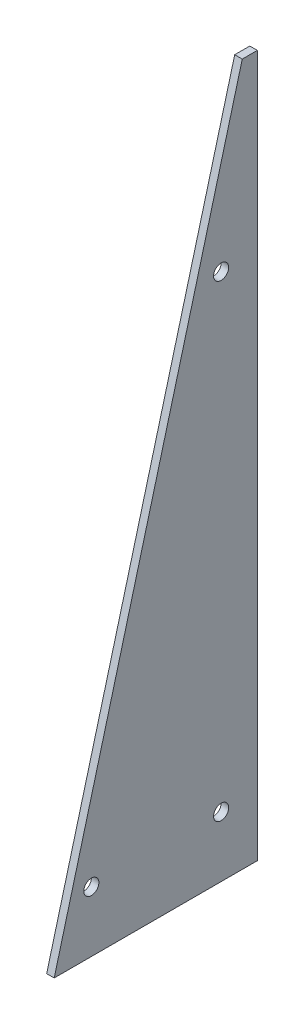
ISO-10303-21;
HEADER;
FILE_DESCRIPTION(('STEP AP214'),'2;1');
FILE_NAME('part.step','',(''),(''),'','','');
FILE_SCHEMA(('AUTOMOTIVE_DESIGN { 1 0 10303 214 1 1 1 1 }'));
ENDSEC;
DATA;
#1=APPLICATION_CONTEXT('core data for automotive mechanical design processes');
#2=APPLICATION_PROTOCOL_DEFINITION('international standard','automotive_design',2000,#1);
#3=PRODUCT_CONTEXT('',#1,'mechanical');
#4=PRODUCT('Part','Part','',(#3));
#5=PRODUCT_RELATED_PRODUCT_CATEGORY('part','',(#4));
#6=PRODUCT_DEFINITION_FORMATION('','',#4);
#7=PRODUCT_DEFINITION_CONTEXT('part definition',#1,'design');
#8=PRODUCT_DEFINITION('design','',#6,#7);
#9=PRODUCT_DEFINITION_SHAPE('','',#8);
#10=(LENGTH_UNIT() NAMED_UNIT(*) SI_UNIT(.MILLI.,.METRE.));
#11=(NAMED_UNIT(*) PLANE_ANGLE_UNIT() SI_UNIT($,.RADIAN.));
#12=(NAMED_UNIT(*) SI_UNIT($,.STERADIAN.) SOLID_ANGLE_UNIT());
#13=UNCERTAINTY_MEASURE_WITH_UNIT(LENGTH_MEASURE(1.E-05),#10,'distance_accuracy_value','');
#14=(GEOMETRIC_REPRESENTATION_CONTEXT(3) GLOBAL_UNCERTAINTY_ASSIGNED_CONTEXT((#13)) GLOBAL_UNIT_ASSIGNED_CONTEXT((#10,
#11,#12)) REPRESENTATION_CONTEXT('',''));
#15=CARTESIAN_POINT('',(0.,0.,0.));
#16=DIRECTION('',(0.,0.,1.));
#17=DIRECTION('',(1.,0.,0.));
#18=AXIS2_PLACEMENT_3D('',#15,#16,#17);
#19=CARTESIAN_POINT('',(6.35,0.,170.937395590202));
#20=DIRECTION('',(0.,1.,0.));
#21=DIRECTION('',(0.,0.,1.));
#22=AXIS2_PLACEMENT_3D('',#19,#20,#21);
#23=PLANE('',#22);
#24=CARTESIAN_POINT('',(3.175,0.,12.7));
#25=DIRECTION('',(0.,-1.,0.));
#26=DIRECTION('',(0.,0.,-1.));
#27=AXIS2_PLACEMENT_3D('',#24,#25,#26);
#28=CIRCLE('',#27,1.35255);
#29=CARTESIAN_POINT('',(3.175,0.,11.34745));
#30=VERTEX_POINT('',#29);
#31=EDGE_CURVE('E123',#30,#30,#28,.T.);
#32=ORIENTED_EDGE('',*,*,#31,.F.);
#33=EDGE_LOOP('',(#32));
#34=FACE_BOUND('',#33,.T.);
#35=CARTESIAN_POINT('',(3.17499999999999,0.,85.725));
#36=DIRECTION('',(0.,-1.,0.));
#37=DIRECTION('',(0.,0.,-1.));
#38=AXIS2_PLACEMENT_3D('',#35,#36,#37);
#39=CIRCLE('',#38,1.35255);
#40=CARTESIAN_POINT('',(3.17499999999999,0.,84.37245));
#41=VERTEX_POINT('',#40);
#42=EDGE_CURVE('E122',#41,#41,#39,.T.);
#43=ORIENTED_EDGE('',*,*,#42,.F.);
#44=EDGE_LOOP('',(#43));
#45=FACE_BOUND('',#44,.T.);
#46=CARTESIAN_POINT('',(3.17499999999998,0.,158.75));
#47=DIRECTION('',(0.,-1.,0.));
#48=DIRECTION('',(0.,0.,-1.));
#49=AXIS2_PLACEMENT_3D('',#46,#47,#48);
#50=CIRCLE('',#49,1.35255);
#51=CARTESIAN_POINT('',(3.17499999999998,0.,157.39745));
#52=VERTEX_POINT('',#51);
#53=EDGE_CURVE('E133',#52,#52,#50,.T.);
#54=ORIENTED_EDGE('',*,*,#53,.F.);
#55=EDGE_LOOP('',(#54));
#56=FACE_BOUND('',#55,.T.);
#57=DIRECTION('',(0.,0.,-1.));
#58=VECTOR('',#57,1.);
#59=CARTESIAN_POINT('',(0.,0.,170.937395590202));
#60=LINE('',#59,#58);
#61=CARTESIAN_POINT('',(0.,0.,170.937395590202));
#62=VERTEX_POINT('',#61);
#63=CARTESIAN_POINT('',(0.,0.,0.));
#64=VERTEX_POINT('',#63);
#65=EDGE_CURVE('E193',#62,#64,#60,.T.);
#66=ORIENTED_EDGE('',*,*,#65,.T.);
#67=DIRECTION('',(-1.,0.,0.));
#68=VECTOR('',#67,1.);
#69=CARTESIAN_POINT('',(6.35,0.,0.));
#70=LINE('',#69,#68);
#71=CARTESIAN_POINT('',(6.35,0.,0.));
#72=VERTEX_POINT('',#71);
#73=EDGE_CURVE('E11',#72,#64,#70,.T.);
#74=ORIENTED_EDGE('',*,*,#73,.F.);
#75=DIRECTION('',(0.,0.,-1.));
#76=VECTOR('',#75,1.);
#77=CARTESIAN_POINT('',(6.35,0.,170.937395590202));
#78=LINE('',#77,#76);
#79=CARTESIAN_POINT('',(6.35,0.,170.937395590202));
#80=VERTEX_POINT('',#79);
#81=EDGE_CURVE('E194',#80,#72,#78,.T.);
#82=ORIENTED_EDGE('',*,*,#81,.F.);
#83=DIRECTION('',(-1.,0.,0.));
#84=VECTOR('',#83,1.);
#85=CARTESIAN_POINT('',(6.35,0.,170.937395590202));
#86=LINE('',#85,#84);
#87=EDGE_CURVE('E200',#80,#62,#86,.T.);
#88=ORIENTED_EDGE('',*,*,#87,.T.);
#89=EDGE_LOOP('',(#66,#74,#82,#88));
#90=FACE_BOUND('',#89,.T.);
#91=ADVANCED_FACE('F37',(#34,#45,#56,#90),#23,.F.);
#92=CARTESIAN_POINT('',(6.35,0.,0.));
#93=DIRECTION('',(0.,0.,1.));
#94=DIRECTION('',(1.,0.,0.));
#95=AXIS2_PLACEMENT_3D('',#92,#93,#94);
#96=PLANE('',#95);
#97=CARTESIAN_POINT('',(3.175,571.5,0.));
#98=DIRECTION('',(0.,0.,-1.));
#99=DIRECTION('',(-1.,0.,0.));
#100=AXIS2_PLACEMENT_3D('',#97,#98,#99);
#101=CIRCLE('',#100,1.1303);
#102=CARTESIAN_POINT('',(2.0447,571.5,0.));
#103=VERTEX_POINT('',#102);
#104=EDGE_CURVE('E139',#103,#103,#101,.T.);
#105=ORIENTED_EDGE('',*,*,#104,.F.);
#106=EDGE_LOOP('',(#105));
#107=FACE_BOUND('',#106,.T.);
#108=CARTESIAN_POINT('',(3.175,462.28,0.));
#109=DIRECTION('',(0.,0.,-1.));
#110=DIRECTION('',(-1.,0.,0.));
#111=AXIS2_PLACEMENT_3D('',#108,#109,#110);
#112=CIRCLE('',#111,1.1303);
#113=CARTESIAN_POINT('',(2.0447,462.28,0.));
#114=VERTEX_POINT('',#113);
#115=EDGE_CURVE('E145',#114,#114,#112,.T.);
#116=ORIENTED_EDGE('',*,*,#115,.F.);
#117=EDGE_LOOP('',(#116));
#118=FACE_BOUND('',#117,.T.);
#119=CARTESIAN_POINT('',(3.175,353.06,0.));
#120=DIRECTION('',(0.,0.,-1.));
#121=DIRECTION('',(-1.,0.,0.));
#122=AXIS2_PLACEMENT_3D('',#119,#120,#121);
#123=CIRCLE('',#122,1.1303);
#124=CARTESIAN_POINT('',(2.0447,353.06,0.));
#125=VERTEX_POINT('',#124);
#126=EDGE_CURVE('E151',#125,#125,#123,.T.);
#127=ORIENTED_EDGE('',*,*,#126,.F.);
#128=EDGE_LOOP('',(#127));
#129=FACE_BOUND('',#128,.T.);
#130=CARTESIAN_POINT('',(3.175,243.84,0.));
#131=DIRECTION('',(0.,0.,-1.));
#132=DIRECTION('',(-1.,0.,0.));
#133=AXIS2_PLACEMENT_3D('',#130,#131,#132);
#134=CIRCLE('',#133,1.1303);
#135=CARTESIAN_POINT('',(2.0447,243.84,0.));
#136=VERTEX_POINT('',#135);
#137=EDGE_CURVE('E157',#136,#136,#134,.T.);
#138=ORIENTED_EDGE('',*,*,#137,.F.);
#139=EDGE_LOOP('',(#138));
#140=FACE_BOUND('',#139,.T.);
#141=CARTESIAN_POINT('',(3.175,134.62,0.));
#142=DIRECTION('',(0.,0.,-1.));
#143=DIRECTION('',(-1.,0.,0.));
#144=AXIS2_PLACEMENT_3D('',#141,#142,#143);
#145=CIRCLE('',#144,1.1303);
#146=CARTESIAN_POINT('',(2.0447,134.62,0.));
#147=VERTEX_POINT('',#146);
#148=EDGE_CURVE('E163',#147,#147,#145,.T.);
#149=ORIENTED_EDGE('',*,*,#148,.F.);
#150=EDGE_LOOP('',(#149));
#151=FACE_BOUND('',#150,.T.);
#152=CARTESIAN_POINT('',(3.175,25.4,0.));
#153=DIRECTION('',(0.,0.,-1.));
#154=DIRECTION('',(-1.,0.,0.));
#155=AXIS2_PLACEMENT_3D('',#152,#153,#154);
#156=CIRCLE('',#155,1.1303);
#157=CARTESIAN_POINT('',(2.0447,25.4,0.));
#158=VERTEX_POINT('',#157);
#159=EDGE_CURVE('E169',#158,#158,#156,.T.);
#160=ORIENTED_EDGE('',*,*,#159,.F.);
#161=EDGE_LOOP('',(#160));
#162=FACE_BOUND('',#161,.T.);
#163=DIRECTION('',(0.,1.,0.));
#164=VECTOR('',#163,1.);
#165=CARTESIAN_POINT('',(0.,0.,0.));
#166=LINE('',#165,#164);
#167=CARTESIAN_POINT('',(0.,590.55,0.));
#168=VERTEX_POINT('',#167);
#169=EDGE_CURVE('E203',#64,#168,#166,.T.);
#170=ORIENTED_EDGE('',*,*,#169,.T.);
#171=DIRECTION('',(-1.,0.,0.));
#172=VECTOR('',#171,1.);
#173=CARTESIAN_POINT('',(6.35,590.55,0.));
#174=LINE('',#173,#172);
#175=CARTESIAN_POINT('',(6.35,590.55,0.));
#176=VERTEX_POINT('',#175);
#177=EDGE_CURVE('E45',#176,#168,#174,.T.);
#178=ORIENTED_EDGE('',*,*,#177,.F.);
#179=DIRECTION('',(0.,1.,0.));
#180=VECTOR('',#179,1.);
#181=CARTESIAN_POINT('',(6.35,0.,0.));
#182=LINE('',#181,#180);
#183=EDGE_CURVE('E84',#72,#176,#182,.T.);
#184=ORIENTED_EDGE('',*,*,#183,.F.);
#185=ORIENTED_EDGE('',*,*,#73,.T.);
#186=EDGE_LOOP('',(#170,#178,#184,#185));
#187=FACE_BOUND('',#186,.T.);
#188=ADVANCED_FACE('F227',(#107,#118,#129,#140,#151,#162,#187),#96,.F.);
#189=CARTESIAN_POINT('',(6.35,590.55,0.));
#190=DIRECTION('',(0.,-1.,0.));
#191=DIRECTION('',(0.,0.,-1.));
#192=AXIS2_PLACEMENT_3D('',#189,#190,#191);
#193=PLANE('',#192);
#194=DIRECTION('',(0.,0.,1.));
#195=VECTOR('',#194,1.);
#196=CARTESIAN_POINT('',(0.,590.55,0.));
#197=LINE('',#196,#195);
#198=CARTESIAN_POINT('',(0.,590.55,12.7));
#199=VERTEX_POINT('',#198);
#200=EDGE_CURVE('E71',#168,#199,#197,.T.);
#201=ORIENTED_EDGE('',*,*,#200,.T.);
#202=DIRECTION('',(-1.,0.,0.));
#203=VECTOR('',#202,1.);
#204=CARTESIAN_POINT('',(6.35,590.55,12.7));
#205=LINE('',#204,#203);
#206=CARTESIAN_POINT('',(6.35,590.55,12.7));
#207=VERTEX_POINT('',#206);
#208=EDGE_CURVE('E208',#207,#199,#205,.T.);
#209=ORIENTED_EDGE('',*,*,#208,.F.);
#210=DIRECTION('',(0.,0.,1.));
#211=VECTOR('',#210,1.);
#212=CARTESIAN_POINT('',(6.35,590.55,0.));
#213=LINE('',#212,#211);
#214=EDGE_CURVE('E197',#176,#207,#213,.T.);
#215=ORIENTED_EDGE('',*,*,#214,.F.);
#216=ORIENTED_EDGE('',*,*,#177,.T.);
#217=EDGE_LOOP('',(#201,#209,#215,#216));
#218=FACE_BOUND('',#217,.T.);
#219=ADVANCED_FACE('F210',(#218),#193,.F.);
#220=CARTESIAN_POINT('',(6.35,590.55,12.7));
#221=DIRECTION('',(0.,-0.258819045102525,-0.965925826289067));
#222=DIRECTION('',(0.,0.965925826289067,-0.258819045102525));
#223=AXIS2_PLACEMENT_3D('',#220,#221,#222);
#224=PLANE('',#223);
#225=DIRECTION('',(0.,-0.965925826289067,0.258819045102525));
#226=VECTOR('',#225,1.);
#227=CARTESIAN_POINT('',(0.,590.55,12.7));
#228=LINE('',#227,#226);
#229=EDGE_CURVE('E77',#199,#62,#228,.T.);
#230=ORIENTED_EDGE('',*,*,#229,.T.);
#231=ORIENTED_EDGE('',*,*,#87,.F.);
#232=DIRECTION('',(0.,-0.965925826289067,0.258819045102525));
#233=VECTOR('',#232,1.);
#234=CARTESIAN_POINT('',(6.35,590.55,12.7));
#235=LINE('',#234,#233);
#236=EDGE_CURVE('E53',#207,#80,#235,.T.);
#237=ORIENTED_EDGE('',*,*,#236,.F.);
#238=ORIENTED_EDGE('',*,*,#208,.T.);
#239=EDGE_LOOP('',(#230,#231,#237,#238));
#240=FACE_BOUND('',#239,.T.);
#241=ADVANCED_FACE('F217',(#240),#224,.F.);
#242=CARTESIAN_POINT('',(6.35,0.,0.));
#243=DIRECTION('',(1.,0.,0.));
#244=DIRECTION('',(0.,0.,-1.));
#245=AXIS2_PLACEMENT_3D('',#242,#243,#244);
#246=PLANE('',#245);
#247=CARTESIAN_POINT('',(6.35,50.8,139.7));
#248=DIRECTION('',(1.,0.,0.));
#249=DIRECTION('',(0.,0.,-1.));
#250=AXIS2_PLACEMENT_3D('',#247,#248,#249);
#251=CIRCLE('',#250,6.34999999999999);
#252=CARTESIAN_POINT('',(6.35,50.8,133.35));
#253=VERTEX_POINT('',#252);
#254=EDGE_CURVE('E175',#253,#253,#251,.T.);
#255=ORIENTED_EDGE('',*,*,#254,.F.);
#256=EDGE_LOOP('',(#255));
#257=FACE_BOUND('',#256,.T.);
#258=CARTESIAN_POINT('',(6.35,50.8,30.48));
#259=DIRECTION('',(1.,0.,0.));
#260=DIRECTION('',(0.,0.,-1.));
#261=AXIS2_PLACEMENT_3D('',#258,#259,#260);
#262=CIRCLE('',#261,6.34999999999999);
#263=CARTESIAN_POINT('',(6.35,50.8,24.13));
#264=VERTEX_POINT('',#263);
#265=EDGE_CURVE('E181',#264,#264,#262,.T.);
#266=ORIENTED_EDGE('',*,*,#265,.F.);
#267=EDGE_LOOP('',(#266));
#268=FACE_BOUND('',#267,.T.);
#269=CARTESIAN_POINT('',(6.35,444.5,30.48));
#270=DIRECTION('',(1.,0.,0.));
#271=DIRECTION('',(0.,0.,-1.));
#272=AXIS2_PLACEMENT_3D('',#269,#270,#271);
#273=CIRCLE('',#272,6.34999999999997);
#274=CARTESIAN_POINT('',(6.35,444.5,24.13));
#275=VERTEX_POINT('',#274);
#276=EDGE_CURVE('E187',#275,#275,#273,.T.);
#277=ORIENTED_EDGE('',*,*,#276,.F.);
#278=EDGE_LOOP('',(#277));
#279=FACE_BOUND('',#278,.T.);
#280=ORIENTED_EDGE('',*,*,#81,.T.);
#281=ORIENTED_EDGE('',*,*,#183,.T.);
#282=ORIENTED_EDGE('',*,*,#214,.T.);
#283=ORIENTED_EDGE('',*,*,#236,.T.);
#284=EDGE_LOOP('',(#280,#281,#282,#283));
#285=FACE_BOUND('',#284,.T.);
#286=ADVANCED_FACE('F219',(#257,#268,#279,#285),#246,.T.);
#287=CARTESIAN_POINT('',(0.,0.,0.));
#288=DIRECTION('',(1.,0.,0.));
#289=DIRECTION('',(0.,0.,-1.));
#290=AXIS2_PLACEMENT_3D('',#287,#288,#289);
#291=PLANE('',#290);
#292=CARTESIAN_POINT('',(0.,50.8,139.7));
#293=DIRECTION('',(1.,0.,0.));
#294=DIRECTION('',(0.,0.,-1.));
#295=AXIS2_PLACEMENT_3D('',#292,#293,#294);
#296=CIRCLE('',#295,6.35);
#297=CARTESIAN_POINT('',(0.,50.8,133.35));
#298=VERTEX_POINT('',#297);
#299=EDGE_CURVE('E178',#298,#298,#296,.T.);
#300=ORIENTED_EDGE('',*,*,#299,.T.);
#301=EDGE_LOOP('',(#300));
#302=FACE_BOUND('',#301,.T.);
#303=CARTESIAN_POINT('',(0.,50.8,30.48));
#304=DIRECTION('',(1.,0.,0.));
#305=DIRECTION('',(0.,0.,-1.));
#306=AXIS2_PLACEMENT_3D('',#303,#304,#305);
#307=CIRCLE('',#306,6.35);
#308=CARTESIAN_POINT('',(0.,50.8,24.13));
#309=VERTEX_POINT('',#308);
#310=EDGE_CURVE('E184',#309,#309,#307,.T.);
#311=ORIENTED_EDGE('',*,*,#310,.T.);
#312=EDGE_LOOP('',(#311));
#313=FACE_BOUND('',#312,.T.);
#314=CARTESIAN_POINT('',(0.,444.5,30.48));
#315=DIRECTION('',(1.,0.,0.));
#316=DIRECTION('',(0.,0.,-1.));
#317=AXIS2_PLACEMENT_3D('',#314,#315,#316);
#318=CIRCLE('',#317,6.35000000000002);
#319=CARTESIAN_POINT('',(0.,444.5,24.13));
#320=VERTEX_POINT('',#319);
#321=EDGE_CURVE('E190',#320,#320,#318,.T.);
#322=ORIENTED_EDGE('',*,*,#321,.T.);
#323=EDGE_LOOP('',(#322));
#324=FACE_BOUND('',#323,.T.);
#325=ORIENTED_EDGE('',*,*,#65,.F.);
#326=ORIENTED_EDGE('',*,*,#229,.F.);
#327=ORIENTED_EDGE('',*,*,#200,.F.);
#328=ORIENTED_EDGE('',*,*,#169,.F.);
#329=EDGE_LOOP('',(#325,#326,#327,#328));
#330=FACE_BOUND('',#329,.T.);
#331=ADVANCED_FACE('F213',(#302,#313,#324,#330),#291,.F.);
#332=CARTESIAN_POINT('',(6.35,444.5,30.48));
#333=DIRECTION('',(1.,0.,0.));
#334=DIRECTION('',(0.,0.,-1.));
#335=AXIS2_PLACEMENT_3D('',#332,#333,#334);
#336=CYLINDRICAL_SURFACE('',#335,6.34999999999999);
#337=ORIENTED_EDGE('',*,*,#321,.F.);
#338=EDGE_LOOP('',(#337));
#339=FACE_BOUND('',#338,.T.);
#340=ORIENTED_EDGE('',*,*,#276,.T.);
#341=EDGE_LOOP('',(#340));
#342=FACE_BOUND('',#341,.T.);
#343=ADVANCED_FACE('F316',(#339,#342),#336,.F.);
#344=CARTESIAN_POINT('',(6.35,50.8,30.48));
#345=DIRECTION('',(1.,0.,0.));
#346=DIRECTION('',(0.,0.,-1.));
#347=AXIS2_PLACEMENT_3D('',#344,#345,#346);
#348=CYLINDRICAL_SURFACE('',#347,6.34999999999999);
#349=ORIENTED_EDGE('',*,*,#310,.F.);
#350=EDGE_LOOP('',(#349));
#351=FACE_BOUND('',#350,.T.);
#352=ORIENTED_EDGE('',*,*,#265,.T.);
#353=EDGE_LOOP('',(#352));
#354=FACE_BOUND('',#353,.T.);
#355=ADVANCED_FACE('F312',(#351,#354),#348,.F.);
#356=CARTESIAN_POINT('',(6.35,50.8,139.7));
#357=DIRECTION('',(1.,0.,0.));
#358=DIRECTION('',(0.,0.,-1.));
#359=AXIS2_PLACEMENT_3D('',#356,#357,#358);
#360=CYLINDRICAL_SURFACE('',#359,6.34999999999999);
#361=ORIENTED_EDGE('',*,*,#299,.F.);
#362=EDGE_LOOP('',(#361));
#363=FACE_BOUND('',#362,.T.);
#364=ORIENTED_EDGE('',*,*,#254,.T.);
#365=EDGE_LOOP('',(#364));
#366=FACE_BOUND('',#365,.T.);
#367=ADVANCED_FACE('F308',(#363,#366),#360,.F.);
#368=CARTESIAN_POINT('',(3.175,25.4,7.5946));
#369=DIRECTION('',(0.,0.,-1.));
#370=DIRECTION('',(-1.,0.,0.));
#371=AXIS2_PLACEMENT_3D('',#368,#369,#370);
#372=CONICAL_SURFACE('',#371,1.1303,1.02974425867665);
#373=CARTESIAN_POINT('',(3.175,25.4,8.27375275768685));
#374=VERTEX_POINT('',#373);
#375=VERTEX_LOOP('',#374);
#376=FACE_BOUND('',#375,.T.);
#377=CARTESIAN_POINT('',(3.175,25.4,7.5946));
#378=DIRECTION('',(0.,0.,-1.));
#379=DIRECTION('',(-1.,0.,0.));
#380=AXIS2_PLACEMENT_3D('',#377,#378,#379);
#381=CIRCLE('',#380,1.1303);
#382=CARTESIAN_POINT('',(2.0447,25.4,7.5946));
#383=VERTEX_POINT('',#382);
#384=EDGE_CURVE('E172',#383,#383,#381,.T.);
#385=ORIENTED_EDGE('',*,*,#384,.T.);
#386=EDGE_LOOP('',(#385));
#387=FACE_BOUND('',#386,.T.);
#388=ADVANCED_FACE('F304',(#376,#387),#372,.F.);
#389=CARTESIAN_POINT('',(3.175,25.4,0.));
#390=DIRECTION('',(0.,0.,-1.));
#391=DIRECTION('',(-1.,0.,0.));
#392=AXIS2_PLACEMENT_3D('',#389,#390,#391);
#393=CYLINDRICAL_SURFACE('',#392,1.1303);
#394=ORIENTED_EDGE('',*,*,#384,.F.);
#395=EDGE_LOOP('',(#394));
#396=FACE_BOUND('',#395,.T.);
#397=ORIENTED_EDGE('',*,*,#159,.T.);
#398=EDGE_LOOP('',(#397));
#399=FACE_BOUND('',#398,.T.);
#400=ADVANCED_FACE('F300',(#396,#399),#393,.F.);
#401=CARTESIAN_POINT('',(3.175,134.62,7.5946));
#402=DIRECTION('',(0.,0.,-1.));
#403=DIRECTION('',(-1.,0.,0.));
#404=AXIS2_PLACEMENT_3D('',#401,#402,#403);
#405=CONICAL_SURFACE('',#404,1.1303,1.02974425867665);
#406=CARTESIAN_POINT('',(3.175,134.62,8.27375275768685));
#407=VERTEX_POINT('',#406);
#408=VERTEX_LOOP('',#407);
#409=FACE_BOUND('',#408,.T.);
#410=CARTESIAN_POINT('',(3.175,134.62,7.5946));
#411=DIRECTION('',(0.,0.,-1.));
#412=DIRECTION('',(-1.,0.,0.));
#413=AXIS2_PLACEMENT_3D('',#410,#411,#412);
#414=CIRCLE('',#413,1.1303);
#415=CARTESIAN_POINT('',(2.0447,134.62,7.5946));
#416=VERTEX_POINT('',#415);
#417=EDGE_CURVE('E166',#416,#416,#414,.T.);
#418=ORIENTED_EDGE('',*,*,#417,.T.);
#419=EDGE_LOOP('',(#418));
#420=FACE_BOUND('',#419,.T.);
#421=ADVANCED_FACE('F296',(#409,#420),#405,.F.);
#422=CARTESIAN_POINT('',(3.175,134.62,0.));
#423=DIRECTION('',(0.,0.,-1.));
#424=DIRECTION('',(-1.,0.,0.));
#425=AXIS2_PLACEMENT_3D('',#422,#423,#424);
#426=CYLINDRICAL_SURFACE('',#425,1.1303);
#427=ORIENTED_EDGE('',*,*,#417,.F.);
#428=EDGE_LOOP('',(#427));
#429=FACE_BOUND('',#428,.T.);
#430=ORIENTED_EDGE('',*,*,#148,.T.);
#431=EDGE_LOOP('',(#430));
#432=FACE_BOUND('',#431,.T.);
#433=ADVANCED_FACE('F292',(#429,#432),#426,.F.);
#434=CARTESIAN_POINT('',(3.175,243.84,7.5946));
#435=DIRECTION('',(0.,0.,-1.));
#436=DIRECTION('',(-1.,0.,0.));
#437=AXIS2_PLACEMENT_3D('',#434,#435,#436);
#438=CONICAL_SURFACE('',#437,1.1303,1.02974425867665);
#439=CARTESIAN_POINT('',(3.175,243.84,8.27375275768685));
#440=VERTEX_POINT('',#439);
#441=VERTEX_LOOP('',#440);
#442=FACE_BOUND('',#441,.T.);
#443=CARTESIAN_POINT('',(3.175,243.84,7.5946));
#444=DIRECTION('',(0.,0.,-1.));
#445=DIRECTION('',(-1.,0.,0.));
#446=AXIS2_PLACEMENT_3D('',#443,#444,#445);
#447=CIRCLE('',#446,1.1303);
#448=CARTESIAN_POINT('',(2.0447,243.84,7.5946));
#449=VERTEX_POINT('',#448);
#450=EDGE_CURVE('E160',#449,#449,#447,.T.);
#451=ORIENTED_EDGE('',*,*,#450,.T.);
#452=EDGE_LOOP('',(#451));
#453=FACE_BOUND('',#452,.T.);
#454=ADVANCED_FACE('F288',(#442,#453),#438,.F.);
#455=CARTESIAN_POINT('',(3.175,243.84,0.));
#456=DIRECTION('',(0.,0.,-1.));
#457=DIRECTION('',(-1.,0.,0.));
#458=AXIS2_PLACEMENT_3D('',#455,#456,#457);
#459=CYLINDRICAL_SURFACE('',#458,1.1303);
#460=ORIENTED_EDGE('',*,*,#450,.F.);
#461=EDGE_LOOP('',(#460));
#462=FACE_BOUND('',#461,.T.);
#463=ORIENTED_EDGE('',*,*,#137,.T.);
#464=EDGE_LOOP('',(#463));
#465=FACE_BOUND('',#464,.T.);
#466=ADVANCED_FACE('F284',(#462,#465),#459,.F.);
#467=CARTESIAN_POINT('',(3.175,353.06,7.5946));
#468=DIRECTION('',(0.,0.,-1.));
#469=DIRECTION('',(-1.,0.,0.));
#470=AXIS2_PLACEMENT_3D('',#467,#468,#469);
#471=CONICAL_SURFACE('',#470,1.1303,1.02974425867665);
#472=CARTESIAN_POINT('',(3.175,353.06,8.27375275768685));
#473=VERTEX_POINT('',#472);
#474=VERTEX_LOOP('',#473);
#475=FACE_BOUND('',#474,.T.);
#476=CARTESIAN_POINT('',(3.175,353.06,7.5946));
#477=DIRECTION('',(0.,0.,-1.));
#478=DIRECTION('',(-1.,0.,0.));
#479=AXIS2_PLACEMENT_3D('',#476,#477,#478);
#480=CIRCLE('',#479,1.1303);
#481=CARTESIAN_POINT('',(2.0447,353.06,7.5946));
#482=VERTEX_POINT('',#481);
#483=EDGE_CURVE('E154',#482,#482,#480,.T.);
#484=ORIENTED_EDGE('',*,*,#483,.T.);
#485=EDGE_LOOP('',(#484));
#486=FACE_BOUND('',#485,.T.);
#487=ADVANCED_FACE('F280',(#475,#486),#471,.F.);
#488=CARTESIAN_POINT('',(3.175,353.06,0.));
#489=DIRECTION('',(0.,0.,-1.));
#490=DIRECTION('',(-1.,0.,0.));
#491=AXIS2_PLACEMENT_3D('',#488,#489,#490);
#492=CYLINDRICAL_SURFACE('',#491,1.1303);
#493=ORIENTED_EDGE('',*,*,#483,.F.);
#494=EDGE_LOOP('',(#493));
#495=FACE_BOUND('',#494,.T.);
#496=ORIENTED_EDGE('',*,*,#126,.T.);
#497=EDGE_LOOP('',(#496));
#498=FACE_BOUND('',#497,.T.);
#499=ADVANCED_FACE('F276',(#495,#498),#492,.F.);
#500=CARTESIAN_POINT('',(3.175,462.28,7.5946));
#501=DIRECTION('',(0.,0.,-1.));
#502=DIRECTION('',(-1.,0.,0.));
#503=AXIS2_PLACEMENT_3D('',#500,#501,#502);
#504=CONICAL_SURFACE('',#503,1.1303,1.02974425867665);
#505=CARTESIAN_POINT('',(3.175,462.28,8.27375275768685));
#506=VERTEX_POINT('',#505);
#507=VERTEX_LOOP('',#506);
#508=FACE_BOUND('',#507,.T.);
#509=CARTESIAN_POINT('',(3.175,462.28,7.5946));
#510=DIRECTION('',(0.,0.,-1.));
#511=DIRECTION('',(-1.,0.,0.));
#512=AXIS2_PLACEMENT_3D('',#509,#510,#511);
#513=CIRCLE('',#512,1.1303);
#514=CARTESIAN_POINT('',(2.0447,462.28,7.5946));
#515=VERTEX_POINT('',#514);
#516=EDGE_CURVE('E148',#515,#515,#513,.T.);
#517=ORIENTED_EDGE('',*,*,#516,.T.);
#518=EDGE_LOOP('',(#517));
#519=FACE_BOUND('',#518,.T.);
#520=ADVANCED_FACE('F272',(#508,#519),#504,.F.);
#521=CARTESIAN_POINT('',(3.175,462.28,0.));
#522=DIRECTION('',(0.,0.,-1.));
#523=DIRECTION('',(-1.,0.,0.));
#524=AXIS2_PLACEMENT_3D('',#521,#522,#523);
#525=CYLINDRICAL_SURFACE('',#524,1.1303);
#526=ORIENTED_EDGE('',*,*,#516,.F.);
#527=EDGE_LOOP('',(#526));
#528=FACE_BOUND('',#527,.T.);
#529=ORIENTED_EDGE('',*,*,#115,.T.);
#530=EDGE_LOOP('',(#529));
#531=FACE_BOUND('',#530,.T.);
#532=ADVANCED_FACE('F268',(#528,#531),#525,.F.);
#533=CARTESIAN_POINT('',(3.175,571.5,7.5946));
#534=DIRECTION('',(0.,0.,-1.));
#535=DIRECTION('',(-1.,0.,0.));
#536=AXIS2_PLACEMENT_3D('',#533,#534,#535);
#537=CONICAL_SURFACE('',#536,1.1303,1.02974425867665);
#538=CARTESIAN_POINT('',(3.175,571.5,8.27375275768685));
#539=VERTEX_POINT('',#538);
#540=VERTEX_LOOP('',#539);
#541=FACE_BOUND('',#540,.T.);
#542=CARTESIAN_POINT('',(3.175,571.5,7.5946));
#543=DIRECTION('',(0.,0.,-1.));
#544=DIRECTION('',(-1.,0.,0.));
#545=AXIS2_PLACEMENT_3D('',#542,#543,#544);
#546=CIRCLE('',#545,1.1303);
#547=CARTESIAN_POINT('',(2.0447,571.5,7.5946));
#548=VERTEX_POINT('',#547);
#549=EDGE_CURVE('E142',#548,#548,#546,.T.);
#550=ORIENTED_EDGE('',*,*,#549,.T.);
#551=EDGE_LOOP('',(#550));
#552=FACE_BOUND('',#551,.T.);
#553=ADVANCED_FACE('F264',(#541,#552),#537,.F.);
#554=CARTESIAN_POINT('',(3.175,571.5,0.));
#555=DIRECTION('',(0.,0.,-1.));
#556=DIRECTION('',(-1.,0.,0.));
#557=AXIS2_PLACEMENT_3D('',#554,#555,#556);
#558=CYLINDRICAL_SURFACE('',#557,1.1303);
#559=ORIENTED_EDGE('',*,*,#549,.F.);
#560=EDGE_LOOP('',(#559));
#561=FACE_BOUND('',#560,.T.);
#562=ORIENTED_EDGE('',*,*,#104,.T.);
#563=EDGE_LOOP('',(#562));
#564=FACE_BOUND('',#563,.T.);
#565=ADVANCED_FACE('F256',(#561,#564),#558,.F.);
#566=CARTESIAN_POINT('',(3.17499999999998,9.398,158.75));
#567=DIRECTION('',(0.,-1.,0.));
#568=DIRECTION('',(0.,0.,-1.));
#569=AXIS2_PLACEMENT_3D('',#566,#567,#568);
#570=CONICAL_SURFACE('',#569,1.35255,1.02974425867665);
#571=CARTESIAN_POINT('',(3.17499999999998,10.2106940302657,158.75));
#572=VERTEX_POINT('',#571);
#573=VERTEX_LOOP('',#572);
#574=FACE_BOUND('',#573,.T.);
#575=CARTESIAN_POINT('',(3.17499999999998,9.398,158.75));
#576=DIRECTION('',(0.,-1.,0.));
#577=DIRECTION('',(0.,0.,-1.));
#578=AXIS2_PLACEMENT_3D('',#575,#576,#577);
#579=CIRCLE('',#578,1.35255);
#580=CARTESIAN_POINT('',(3.17499999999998,9.398,157.39745));
#581=VERTEX_POINT('',#580);
#582=EDGE_CURVE('E136',#581,#581,#579,.T.);
#583=ORIENTED_EDGE('',*,*,#582,.T.);
#584=EDGE_LOOP('',(#583));
#585=FACE_BOUND('',#584,.T.);
#586=ADVANCED_FACE('F247',(#574,#585),#570,.F.);
#587=CARTESIAN_POINT('',(3.17499999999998,0.,158.75));
#588=DIRECTION('',(0.,-1.,0.));
#589=DIRECTION('',(0.,0.,-1.));
#590=AXIS2_PLACEMENT_3D('',#587,#588,#589);
#591=CYLINDRICAL_SURFACE('',#590,1.35255);
#592=ORIENTED_EDGE('',*,*,#582,.F.);
#593=EDGE_LOOP('',(#592));
#594=FACE_BOUND('',#593,.T.);
#595=ORIENTED_EDGE('',*,*,#53,.T.);
#596=EDGE_LOOP('',(#595));
#597=FACE_BOUND('',#596,.T.);
#598=ADVANCED_FACE('F244',(#594,#597),#591,.F.);
#599=CARTESIAN_POINT('',(3.17499999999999,9.398,85.725));
#600=DIRECTION('',(0.,-1.,0.));
#601=DIRECTION('',(0.,0.,-1.));
#602=AXIS2_PLACEMENT_3D('',#599,#600,#601);
#603=CONICAL_SURFACE('',#602,1.35255,1.02974425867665);
#604=CARTESIAN_POINT('',(3.17499999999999,10.2106940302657,85.725));
#605=VERTEX_POINT('',#604);
#606=VERTEX_LOOP('',#605);
#607=FACE_BOUND('',#606,.T.);
#608=CARTESIAN_POINT('',(3.17499999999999,9.398,85.725));
#609=DIRECTION('',(0.,-1.,0.));
#610=DIRECTION('',(0.,0.,-1.));
#611=AXIS2_PLACEMENT_3D('',#608,#609,#610);
#612=CIRCLE('',#611,1.35255);
#613=CARTESIAN_POINT('',(3.17499999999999,9.398,84.37245));
#614=VERTEX_POINT('',#613);
#615=EDGE_CURVE('E126',#614,#614,#612,.T.);
#616=ORIENTED_EDGE('',*,*,#615,.T.);
#617=EDGE_LOOP('',(#616));
#618=FACE_BOUND('',#617,.T.);
#619=ADVANCED_FACE('F246',(#607,#618),#603,.F.);
#620=CARTESIAN_POINT('',(3.17499999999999,0.,85.725));
#621=DIRECTION('',(0.,-1.,0.));
#622=DIRECTION('',(0.,0.,-1.));
#623=AXIS2_PLACEMENT_3D('',#620,#621,#622);
#624=CYLINDRICAL_SURFACE('',#623,1.35255);
#625=ORIENTED_EDGE('',*,*,#615,.F.);
#626=EDGE_LOOP('',(#625));
#627=FACE_BOUND('',#626,.T.);
#628=ORIENTED_EDGE('',*,*,#42,.T.);
#629=EDGE_LOOP('',(#628));
#630=FACE_BOUND('',#629,.T.);
#631=ADVANCED_FACE('F116',(#627,#630),#624,.F.);
#632=CARTESIAN_POINT('',(3.175,9.398,12.7));
#633=DIRECTION('',(0.,-1.,0.));
#634=DIRECTION('',(0.,0.,-1.));
#635=AXIS2_PLACEMENT_3D('',#632,#633,#634);
#636=CONICAL_SURFACE('',#635,1.35255,1.02974425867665);
#637=CARTESIAN_POINT('',(3.175,10.2106940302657,12.7));
#638=VERTEX_POINT('',#637);
#639=VERTEX_LOOP('',#638);
#640=FACE_BOUND('',#639,.T.);
#641=CARTESIAN_POINT('',(3.175,9.398,12.7));
#642=DIRECTION('',(0.,-1.,0.));
#643=DIRECTION('',(0.,0.,-1.));
#644=AXIS2_PLACEMENT_3D('',#641,#642,#643);
#645=CIRCLE('',#644,1.35255);
#646=CARTESIAN_POINT('',(3.175,9.398,11.34745));
#647=VERTEX_POINT('',#646);
#648=EDGE_CURVE('E120',#647,#647,#645,.T.);
#649=ORIENTED_EDGE('',*,*,#648,.T.);
#650=EDGE_LOOP('',(#649));
#651=FACE_BOUND('',#650,.T.);
#652=ADVANCED_FACE('F112',(#640,#651),#636,.F.);
#653=CARTESIAN_POINT('',(3.175,0.,12.7));
#654=DIRECTION('',(0.,-1.,0.));
#655=DIRECTION('',(0.,0.,-1.));
#656=AXIS2_PLACEMENT_3D('',#653,#654,#655);
#657=CYLINDRICAL_SURFACE('',#656,1.35255);
#658=ORIENTED_EDGE('',*,*,#648,.F.);
#659=EDGE_LOOP('',(#658));
#660=FACE_BOUND('',#659,.T.);
#661=ORIENTED_EDGE('',*,*,#31,.T.);
#662=EDGE_LOOP('',(#661));
#663=FACE_BOUND('',#662,.T.);
#664=ADVANCED_FACE('F115',(#660,#663),#657,.F.);
#665=CLOSED_SHELL('',(#91,#188,#219,#241,#286,#331,#343,#355,#367,#388,#400,#421,#433,#454,#466,
#487,#499,#520,#532,#553,#565,#586,#598,#619,#631,#652,#664));
#666=MANIFOLD_SOLID_BREP('B2',#665);
#667=ADVANCED_BREP_SHAPE_REPRESENTATION('',(#18,#666),#14);
#668=SHAPE_DEFINITION_REPRESENTATION(#9,#667);
ENDSEC;
END-ISO-10303-21;
